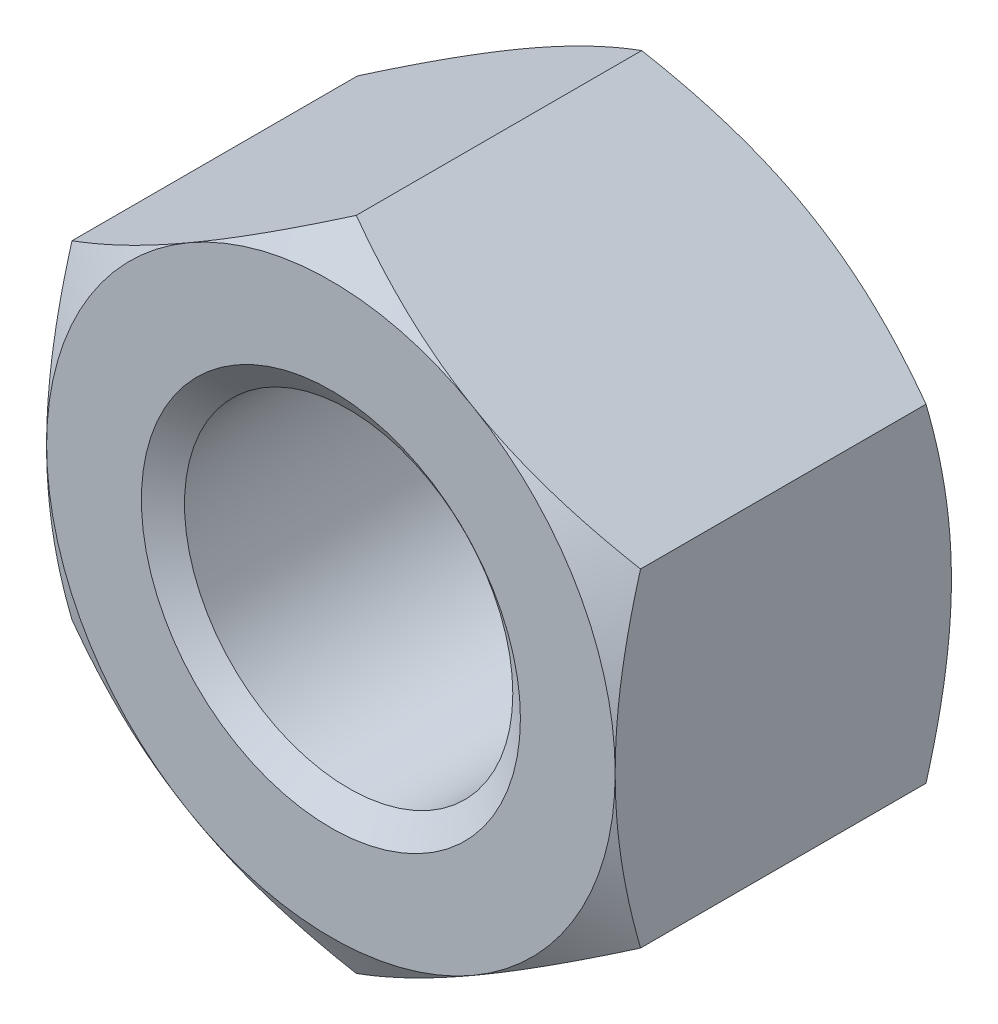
ISO-10303-21;
HEADER;
FILE_DESCRIPTION(('STEP AP214'),'2;1');
FILE_NAME('part.step','',(''),(''),'','','');
FILE_SCHEMA(('AUTOMOTIVE_DESIGN { 1 0 10303 214 1 1 1 1 }'));
ENDSEC;
DATA;
#1=APPLICATION_CONTEXT('core data for automotive mechanical design processes');
#2=APPLICATION_PROTOCOL_DEFINITION('international standard','automotive_design',2000,#1);
#3=PRODUCT_CONTEXT('',#1,'mechanical');
#4=PRODUCT('Part','Part','',(#3));
#5=PRODUCT_RELATED_PRODUCT_CATEGORY('part','',(#4));
#6=PRODUCT_DEFINITION_FORMATION('','',#4);
#7=PRODUCT_DEFINITION_CONTEXT('part definition',#1,'design');
#8=PRODUCT_DEFINITION('design','',#6,#7);
#9=PRODUCT_DEFINITION_SHAPE('','',#8);
#10=(LENGTH_UNIT() NAMED_UNIT(*) SI_UNIT(.MILLI.,.METRE.));
#11=(NAMED_UNIT(*) PLANE_ANGLE_UNIT() SI_UNIT($,.RADIAN.));
#12=(NAMED_UNIT(*) SI_UNIT($,.STERADIAN.) SOLID_ANGLE_UNIT());
#13=UNCERTAINTY_MEASURE_WITH_UNIT(LENGTH_MEASURE(1.E-05),#10,'distance_accuracy_value','');
#14=(GEOMETRIC_REPRESENTATION_CONTEXT(3) GLOBAL_UNCERTAINTY_ASSIGNED_CONTEXT((#13)) GLOBAL_UNIT_ASSIGNED_CONTEXT((#10,
#11,#12)) REPRESENTATION_CONTEXT('',''));
#15=CARTESIAN_POINT('',(0.,0.,0.));
#16=DIRECTION('',(0.,0.,1.));
#17=DIRECTION('',(1.,0.,0.));
#18=AXIS2_PLACEMENT_3D('',#15,#16,#17);
#19=CARTESIAN_POINT('',(0.,0.,-22.5298));
#20=DIRECTION('',(0.,0.,1.));
#21=DIRECTION('',(1.,0.,0.));
#22=AXIS2_PLACEMENT_3D('',#19,#20,#21);
#23=CYLINDRICAL_SURFACE('',#22,11.);
#24=CARTESIAN_POINT('',(0.,0.,-1.1903528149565));
#25=DIRECTION('',(0.,0.,1.));
#26=DIRECTION('',(1.,0.,0.));
#27=AXIS2_PLACEMENT_3D('',#24,#25,#26);
#28=CIRCLE('',#27,11.);
#29=CARTESIAN_POINT('',(11.,0.,-1.1903528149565));
#30=VERTEX_POINT('',#29);
#31=EDGE_CURVE('E150',#30,#30,#28,.F.);
#32=ORIENTED_EDGE('',*,*,#31,.F.);
#33=EDGE_LOOP('',(#32));
#34=FACE_BOUND('',#33,.T.);
#35=CARTESIAN_POINT('',(0.,0.,-21.3140471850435));
#36=DIRECTION('',(0.,0.,-1.));
#37=DIRECTION('',(-1.,0.,0.));
#38=AXIS2_PLACEMENT_3D('',#35,#36,#37);
#39=CIRCLE('',#38,11.);
#40=CARTESIAN_POINT('',(-11.,0.,-21.3140471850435));
#41=VERTEX_POINT('',#40);
#42=EDGE_CURVE('E40',#41,#41,#39,.F.);
#43=ORIENTED_EDGE('',*,*,#42,.F.);
#44=EDGE_LOOP('',(#43));
#45=FACE_BOUND('',#44,.T.);
#46=ADVANCED_FACE('F35',(#34,#45),#23,.F.);
#47=CARTESIAN_POINT('',(-38.1,0.,-22.5298));
#48=DIRECTION('',(0.,0.,1.));
#49=DIRECTION('',(1.,0.,0.));
#50=AXIS2_PLACEMENT_3D('',#47,#48,#49);
#51=PLANE('',#50);
#52=CARTESIAN_POINT('',(0.,0.,-22.5298));
#53=DIRECTION('',(0.,0.,1.));
#54=DIRECTION('',(1.,0.,0.));
#55=AXIS2_PLACEMENT_3D('',#52,#53,#54);
#56=CIRCLE('',#55,19.05);
#57=CARTESIAN_POINT('',(19.05,0.,-22.5298));
#58=VERTEX_POINT('',#57);
#59=CARTESIAN_POINT('',(9.52500000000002,16.4977839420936,-22.5298));
#60=VERTEX_POINT('',#59);
#61=EDGE_CURVE('E157',#58,#60,#56,.T.);
#62=ORIENTED_EDGE('',*,*,#61,.F.);
#63=CARTESIAN_POINT('',(0.,0.,-22.5298));
#64=DIRECTION('',(0.,0.,1.));
#65=DIRECTION('',(1.,0.,0.));
#66=AXIS2_PLACEMENT_3D('',#63,#64,#65);
#67=CIRCLE('',#66,19.05);
#68=CARTESIAN_POINT('',(9.52500000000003,-16.4977839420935,-22.5298));
#69=VERTEX_POINT('',#68);
#70=EDGE_CURVE('E262',#58,#69,#67,.F.);
#71=ORIENTED_EDGE('',*,*,#70,.T.);
#72=CARTESIAN_POINT('',(-9.52500000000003,-16.4977839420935,-22.5298));
#73=VERTEX_POINT('',#72);
#74=EDGE_CURVE('E264',#69,#73,#67,.F.);
#75=ORIENTED_EDGE('',*,*,#74,.T.);
#76=CARTESIAN_POINT('',(-19.05,0.,-22.5298));
#77=VERTEX_POINT('',#76);
#78=EDGE_CURVE('E389',#73,#77,#67,.F.);
#79=ORIENTED_EDGE('',*,*,#78,.T.);
#80=CARTESIAN_POINT('',(-9.52500000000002,16.4977839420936,-22.5298));
#81=VERTEX_POINT('',#80);
#82=EDGE_CURVE('E392',#77,#81,#67,.F.);
#83=ORIENTED_EDGE('',*,*,#82,.T.);
#84=EDGE_CURVE('E247',#81,#60,#67,.F.);
#85=ORIENTED_EDGE('',*,*,#84,.T.);
#86=EDGE_LOOP('',(#62,#71,#75,#79,#83,#85));
#87=FACE_BOUND('',#86,.T.);
#88=CARTESIAN_POINT('',(0.,0.,-22.5298));
#89=DIRECTION('',(0.,0.,1.));
#90=DIRECTION('',(1.,0.,0.));
#91=AXIS2_PLACEMENT_3D('',#88,#89,#90);
#92=CIRCLE('',#91,12.7);
#93=CARTESIAN_POINT('',(12.7,0.,-22.5298));
#94=VERTEX_POINT('',#93);
#95=EDGE_CURVE('E269',#94,#94,#92,.F.);
#96=ORIENTED_EDGE('',*,*,#95,.F.);
#97=EDGE_LOOP('',(#96));
#98=FACE_BOUND('',#97,.T.);
#99=ADVANCED_FACE('F285',(#87,#98),#51,.F.);
#100=CARTESIAN_POINT('',(-38.1,0.,0.));
#101=DIRECTION('',(0.,0.,1.));
#102=DIRECTION('',(1.,0.,0.));
#103=AXIS2_PLACEMENT_3D('',#100,#101,#102);
#104=PLANE('',#103);
#105=CARTESIAN_POINT('',(0.,0.,0.));
#106=DIRECTION('',(0.,0.,1.));
#107=DIRECTION('',(1.,0.,0.));
#108=AXIS2_PLACEMENT_3D('',#105,#106,#107);
#109=CIRCLE('',#108,19.05);
#110=CARTESIAN_POINT('',(9.52500000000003,-16.4977839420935,0.));
#111=VERTEX_POINT('',#110);
#112=CARTESIAN_POINT('',(19.05,0.,0.));
#113=VERTEX_POINT('',#112);
#114=EDGE_CURVE('E47',#111,#113,#109,.T.);
#115=ORIENTED_EDGE('',*,*,#114,.T.);
#116=CARTESIAN_POINT('',(0.,0.,0.));
#117=DIRECTION('',(0.,0.,1.));
#118=DIRECTION('',(1.,0.,0.));
#119=AXIS2_PLACEMENT_3D('',#116,#117,#118);
#120=CIRCLE('',#119,19.05);
#121=CARTESIAN_POINT('',(9.52500000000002,16.4977839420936,0.));
#122=VERTEX_POINT('',#121);
#123=EDGE_CURVE('E54',#113,#122,#120,.T.);
#124=ORIENTED_EDGE('',*,*,#123,.T.);
#125=CARTESIAN_POINT('',(-9.52500000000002,16.4977839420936,0.));
#126=VERTEX_POINT('',#125);
#127=EDGE_CURVE('E11',#122,#126,#109,.T.);
#128=ORIENTED_EDGE('',*,*,#127,.T.);
#129=CARTESIAN_POINT('',(-19.05,0.,0.));
#130=VERTEX_POINT('',#129);
#131=EDGE_CURVE('E45',#126,#130,#109,.T.);
#132=ORIENTED_EDGE('',*,*,#131,.T.);
#133=CARTESIAN_POINT('',(-9.52500000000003,-16.4977839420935,0.));
#134=VERTEX_POINT('',#133);
#135=EDGE_CURVE('E338',#130,#134,#109,.T.);
#136=ORIENTED_EDGE('',*,*,#135,.T.);
#137=EDGE_CURVE('E266',#134,#111,#109,.T.);
#138=ORIENTED_EDGE('',*,*,#137,.T.);
#139=EDGE_LOOP('',(#115,#124,#128,#132,#136,#138));
#140=FACE_BOUND('',#139,.T.);
#141=CARTESIAN_POINT('',(0.,0.,0.));
#142=DIRECTION('',(0.,0.,1.));
#143=DIRECTION('',(1.,0.,0.));
#144=AXIS2_PLACEMENT_3D('',#141,#142,#143);
#145=CIRCLE('',#144,12.7);
#146=CARTESIAN_POINT('',(12.7,0.,0.));
#147=VERTEX_POINT('',#146);
#148=EDGE_CURVE('E268',#147,#147,#145,.T.);
#149=ORIENTED_EDGE('',*,*,#148,.F.);
#150=EDGE_LOOP('',(#149));
#151=FACE_BOUND('',#150,.T.);
#152=ADVANCED_FACE('F145',(#140,#151),#104,.T.);
#153=CARTESIAN_POINT('',(0.,21.9970452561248,-22.5298));
#154=DIRECTION('',(-0.500000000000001,0.866025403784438,0.));
#155=DIRECTION('',(-0.866025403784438,-0.500000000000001,0.));
#156=AXIS2_PLACEMENT_3D('',#153,#154,#155);
#157=PLANE('',#156);
#158=DIRECTION('',(0.,0.,1.));
#159=VECTOR('',#158,1.);
#160=CARTESIAN_POINT('',(-19.05,10.9985226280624,-22.5298));
#161=LINE('',#160,#159);
#162=CARTESIAN_POINT('',(-19.05,10.9985226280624,-20.8283226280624));
#163=VERTEX_POINT('',#162);
#164=CARTESIAN_POINT('',(-19.05,10.9985226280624,-1.70147737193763));
#165=VERTEX_POINT('',#164);
#166=EDGE_CURVE('E259',#163,#165,#161,.T.);
#167=ORIENTED_EDGE('',*,*,#166,.T.);
#168=CARTESIAN_POINT('',(-19.0502,10.9984071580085,-1.70154403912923));
#169=CARTESIAN_POINT('',(-18.6314889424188,11.2401500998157,-1.56198341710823));
#170=CARTESIAN_POINT('',(-18.2111446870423,11.4828359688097,-1.42875584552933));
#171=CARTESIAN_POINT('',(-17.3670855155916,11.9701537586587,-1.17672716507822));
#172=CARTESIAN_POINT('',(-16.9433695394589,12.2147862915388,-1.05793080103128));
#173=CARTESIAN_POINT('',(-16.0917480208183,12.7064702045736,-0.836361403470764));
#174=CARTESIAN_POINT('',(-15.6638350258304,12.9535258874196,-0.733626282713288));
#175=CARTESIAN_POINT('',(-14.8050356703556,13.4493539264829,-0.546385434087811));
#176=CARTESIAN_POINT('',(-14.374149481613,13.6981261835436,-0.461878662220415));
#177=CARTESIAN_POINT('',(-13.5204444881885,14.1910129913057,-0.314688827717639));
#178=CARTESIAN_POINT('',(-13.0976890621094,14.4350909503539,-0.251518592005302));
#179=CARTESIAN_POINT('',(-12.250241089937,14.9243652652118,-0.14559634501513));
#180=CARTESIAN_POINT('',(-11.8255485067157,15.1695616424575,-0.102844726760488));
#181=CARTESIAN_POINT('',(-10.9754499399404,15.6603662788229,-0.0388391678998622));
#182=CARTESIAN_POINT('',(-10.5500454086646,15.9059736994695,-0.0175596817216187));
#183=CARTESIAN_POINT('',(-9.6988436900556,16.397415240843,0.00304398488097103));
#184=CARTESIAN_POINT('',(-9.27304651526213,16.6432493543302,0.00236884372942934));
#185=CARTESIAN_POINT('',(-8.47700964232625,17.1028414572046,-0.0194033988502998));
#186=CARTESIAN_POINT('',(-8.10671322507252,17.316632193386,-0.0378455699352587));
#187=CARTESIAN_POINT('',(-7.36700369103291,17.7437036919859,-0.0909844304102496));
#188=CARTESIAN_POINT('',(-6.99759056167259,17.9569844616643,-0.125680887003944));
#189=CARTESIAN_POINT('',(-6.25978756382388,18.3829552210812,-0.210726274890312));
#190=CARTESIAN_POINT('',(-5.89139892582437,18.5956445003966,-0.261089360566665));
#191=CARTESIAN_POINT('',(-5.15637533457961,19.0200105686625,-0.376579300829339));
#192=CARTESIAN_POINT('',(-4.78974037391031,19.2316873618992,-0.441706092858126));
#193=CARTESIAN_POINT('',(-3.6767727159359,19.8742595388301,-0.660888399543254));
#194=CARTESIAN_POINT('',(-2.93366305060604,20.3032941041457,-0.836799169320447));
#195=CARTESIAN_POINT('',(-1.45852420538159,21.1549659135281,-1.23604434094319));
#196=CARTESIAN_POINT('',(-0.726476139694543,21.5776140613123,-1.45928498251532));
#197=CARTESIAN_POINT('',(0.000199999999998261,21.9971607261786,-1.70154403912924));
#198=B_SPLINE_CURVE_WITH_KNOTS('',3,(#168,#169,#170,#171,#172,#173,#174,#175,#176,#177,#178,
#179,#180,#181,#182,#183,#184,#185,#186,#187,#188,#189,#190,#191,#192,#193,#194,#195,#196,#197),
.UNSPECIFIED.,.F.,.F.,(4,2,2,2,2,2,2,2,2,2,2,2,2,2,4),(0.,1.50971559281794,3.01992622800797,
4.53364959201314,6.04728623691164,7.52356313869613,8.99986845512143,10.4744153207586,
11.9489166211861,13.2325441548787,14.5161533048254,15.8009255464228,17.085692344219,
19.7118183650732,22.3327898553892),.UNSPECIFIED.);
#199=EDGE_CURVE('E62',#165,#126,#198,.T.);
#200=ORIENTED_EDGE('',*,*,#199,.T.);
#201=CARTESIAN_POINT('',(0.,21.9970452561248,-1.70147737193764));
#202=VERTEX_POINT('',#201);
#203=EDGE_CURVE('E141',#126,#202,#198,.T.);
#204=ORIENTED_EDGE('',*,*,#203,.T.);
#205=DIRECTION('',(0.,0.,1.));
#206=VECTOR('',#205,1.);
#207=CARTESIAN_POINT('',(0.,21.9970452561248,-22.5298));
#208=LINE('',#207,#206);
#209=CARTESIAN_POINT('',(0.,21.9970452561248,-20.8283226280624));
#210=VERTEX_POINT('',#209);
#211=EDGE_CURVE('E156',#210,#202,#208,.T.);
#212=ORIENTED_EDGE('',*,*,#211,.F.);
#213=CARTESIAN_POINT('',(-19.0502,10.9984071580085,-20.8282559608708));
#214=CARTESIAN_POINT('',(-18.6314889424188,11.2401500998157,-20.9678165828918));
#215=CARTESIAN_POINT('',(-18.2111446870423,11.4828359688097,-21.1010441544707));
#216=CARTESIAN_POINT('',(-17.3670855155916,11.9701537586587,-21.3530728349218));
#217=CARTESIAN_POINT('',(-16.9433695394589,12.2147862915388,-21.4718691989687));
#218=CARTESIAN_POINT('',(-16.0917480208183,12.7064702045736,-21.6934385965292));
#219=CARTESIAN_POINT('',(-15.6638350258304,12.9535258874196,-21.7961737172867));
#220=CARTESIAN_POINT('',(-14.8050356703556,13.4493539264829,-21.9834145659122));
#221=CARTESIAN_POINT('',(-14.374149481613,13.6981261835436,-22.0679213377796));
#222=CARTESIAN_POINT('',(-13.5204444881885,14.1910129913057,-22.2151111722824));
#223=CARTESIAN_POINT('',(-13.0976890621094,14.4350909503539,-22.2782814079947));
#224=CARTESIAN_POINT('',(-12.250241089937,14.9243652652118,-22.3842036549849));
#225=CARTESIAN_POINT('',(-11.8255485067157,15.1695616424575,-22.4269552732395));
#226=CARTESIAN_POINT('',(-10.9754499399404,15.6603662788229,-22.4909608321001));
#227=CARTESIAN_POINT('',(-10.5500454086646,15.9059736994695,-22.5122403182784));
#228=CARTESIAN_POINT('',(-9.6988436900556,16.397415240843,-22.532843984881));
#229=CARTESIAN_POINT('',(-9.27304651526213,16.6432493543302,-22.5321688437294));
#230=CARTESIAN_POINT('',(-8.47700964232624,17.1028414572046,-22.5103966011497));
#231=CARTESIAN_POINT('',(-8.10671322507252,17.316632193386,-22.4919544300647));
#232=CARTESIAN_POINT('',(-7.3670036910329,17.7437036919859,-22.4388155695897));
#233=CARTESIAN_POINT('',(-6.99759056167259,17.9569844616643,-22.4041191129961));
#234=CARTESIAN_POINT('',(-6.25978756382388,18.3829552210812,-22.3190737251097));
#235=CARTESIAN_POINT('',(-5.89139892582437,18.5956445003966,-22.2687106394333));
#236=CARTESIAN_POINT('',(-5.15637533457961,19.0200105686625,-22.1532206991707));
#237=CARTESIAN_POINT('',(-4.7897403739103,19.2316873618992,-22.0880939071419));
#238=CARTESIAN_POINT('',(-3.67677271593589,19.8742595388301,-21.8689116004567));
#239=CARTESIAN_POINT('',(-2.93366305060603,20.3032941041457,-21.6930008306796));
#240=CARTESIAN_POINT('',(-1.45852420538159,21.1549659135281,-21.2937556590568));
#241=CARTESIAN_POINT('',(-0.726476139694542,21.5776140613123,-21.0705150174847));
#242=CARTESIAN_POINT('',(0.000199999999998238,21.9971607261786,-20.8282559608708));
#243=B_SPLINE_CURVE_WITH_KNOTS('',3,(#213,#214,#215,#216,#217,#218,#219,#220,#221,#222,#223,
#224,#225,#226,#227,#228,#229,#230,#231,#232,#233,#234,#235,#236,#237,#238,#239,#240,#241,#242),
.UNSPECIFIED.,.F.,.F.,(4,2,2,2,2,2,2,2,2,2,2,2,2,2,4),(0.,1.50971559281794,3.01992622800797,
4.53364959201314,6.04728623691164,7.52356313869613,8.99986845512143,10.4744153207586,
11.9489166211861,13.2325441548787,14.5161533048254,15.8009255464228,17.085692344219,
19.7118183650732,22.3327898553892),.UNSPECIFIED.);
#244=EDGE_CURVE('E239',#81,#210,#243,.T.);
#245=ORIENTED_EDGE('',*,*,#244,.F.);
#246=EDGE_CURVE('E227',#163,#81,#243,.T.);
#247=ORIENTED_EDGE('',*,*,#246,.F.);
#248=EDGE_LOOP('',(#167,#200,#204,#212,#245,#247));
#249=FACE_BOUND('',#248,.T.);
#250=ADVANCED_FACE('F37',(#249),#157,.T.);
#251=CARTESIAN_POINT('',(19.05,10.9985226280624,-22.5298));
#252=DIRECTION('',(0.500000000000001,0.866025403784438,0.));
#253=DIRECTION('',(-0.866025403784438,0.500000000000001,0.));
#254=AXIS2_PLACEMENT_3D('',#251,#252,#253);
#255=PLANE('',#254);
#256=ORIENTED_EDGE('',*,*,#211,.T.);
#257=CARTESIAN_POINT('',(-0.000200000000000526,21.9971607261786,-1.70154403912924));
#258=CARTESIAN_POINT('',(0.418511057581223,21.7554177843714,-1.56198341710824));
#259=CARTESIAN_POINT('',(0.83885531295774,21.5127319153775,-1.42875584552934));
#260=CARTESIAN_POINT('',(1.68291448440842,21.0254141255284,-1.17672716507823));
#261=CARTESIAN_POINT('',(2.10663046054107,20.7807815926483,-1.05793080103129));
#262=CARTESIAN_POINT('',(2.95825197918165,20.2890976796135,-0.836361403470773));
#263=CARTESIAN_POINT('',(3.38616497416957,20.0420419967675,-0.733626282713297));
#264=CARTESIAN_POINT('',(4.24496432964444,19.5462139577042,-0.54638543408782));
#265=CARTESIAN_POINT('',(4.67585051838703,19.2974417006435,-0.461878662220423));
#266=CARTESIAN_POINT('',(5.52955551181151,18.8045548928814,-0.314688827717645));
#267=CARTESIAN_POINT('',(5.95231093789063,18.5604769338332,-0.251518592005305));
#268=CARTESIAN_POINT('',(6.79975891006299,18.0712026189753,-0.145596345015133));
#269=CARTESIAN_POINT('',(7.22445149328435,17.8260062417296,-0.102844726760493));
#270=CARTESIAN_POINT('',(8.07455006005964,17.3352016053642,-0.0388391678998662));
#271=CARTESIAN_POINT('',(8.49995459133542,17.0895941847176,-0.0175596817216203));
#272=CARTESIAN_POINT('',(9.35115630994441,16.5981526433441,0.00304398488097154));
#273=CARTESIAN_POINT('',(9.77695348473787,16.3523185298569,0.00236884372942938));
#274=CARTESIAN_POINT('',(10.5729903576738,15.8927264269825,-0.019403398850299));
#275=CARTESIAN_POINT('',(10.9432867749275,15.6789356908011,-0.0378455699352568));
#276=CARTESIAN_POINT('',(11.6829963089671,15.2518641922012,-0.090984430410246));
#277=CARTESIAN_POINT('',(12.0524094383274,15.0385834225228,-0.12568088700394));
#278=CARTESIAN_POINT('',(12.7902124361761,14.612612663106,-0.210726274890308));
#279=CARTESIAN_POINT('',(13.1586010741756,14.3999233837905,-0.261089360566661));
#280=CARTESIAN_POINT('',(13.8936246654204,13.9755573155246,-0.376579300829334));
#281=CARTESIAN_POINT('',(14.2602596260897,13.7638805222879,-0.441706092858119));
#282=CARTESIAN_POINT('',(15.3732272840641,13.121308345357,-0.660888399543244));
#283=CARTESIAN_POINT('',(16.116336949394,12.6922737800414,-0.836799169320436));
#284=CARTESIAN_POINT('',(17.5914757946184,11.840601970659,-1.23604434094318));
#285=CARTESIAN_POINT('',(18.3235238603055,11.4179538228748,-1.45928498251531));
#286=CARTESIAN_POINT('',(19.0502,10.9984071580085,-1.70154403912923));
#287=B_SPLINE_CURVE_WITH_KNOTS('',3,(#257,#258,#259,#260,#261,#262,#263,#264,#265,#266,#267,
#268,#269,#270,#271,#272,#273,#274,#275,#276,#277,#278,#279,#280,#281,#282,#283,#284,#285,#286),
.UNSPECIFIED.,.F.,.F.,(4,2,2,2,2,2,2,2,2,2,2,2,2,2,4),(0.,1.50971559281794,3.01992622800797,
4.53364959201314,6.04728623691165,7.52356313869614,8.99986845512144,10.4744153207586,
11.9489166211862,13.2325441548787,14.5161533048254,15.8009255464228,17.085692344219,
19.7118183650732,22.3327898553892),.UNSPECIFIED.);
#288=EDGE_CURVE('E136',#202,#122,#287,.T.);
#289=ORIENTED_EDGE('',*,*,#288,.T.);
#290=CARTESIAN_POINT('',(19.05,10.9985226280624,-1.70147737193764));
#291=VERTEX_POINT('',#290);
#292=EDGE_CURVE('E127',#122,#291,#287,.T.);
#293=ORIENTED_EDGE('',*,*,#292,.T.);
#294=DIRECTION('',(0.,0.,1.));
#295=VECTOR('',#294,1.);
#296=CARTESIAN_POINT('',(19.05,10.9985226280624,-22.5298));
#297=LINE('',#296,#295);
#298=CARTESIAN_POINT('',(19.05,10.9985226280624,-20.8283226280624));
#299=VERTEX_POINT('',#298);
#300=EDGE_CURVE('E248',#299,#291,#297,.T.);
#301=ORIENTED_EDGE('',*,*,#300,.F.);
#302=CARTESIAN_POINT('',(-0.000200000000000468,21.9971607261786,-20.8282559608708));
#303=CARTESIAN_POINT('',(0.418511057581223,21.7554177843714,-20.9678165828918));
#304=CARTESIAN_POINT('',(0.838855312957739,21.5127319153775,-21.1010441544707));
#305=CARTESIAN_POINT('',(1.68291448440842,21.0254141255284,-21.3530728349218));
#306=CARTESIAN_POINT('',(2.10663046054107,20.7807815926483,-21.4718691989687));
#307=CARTESIAN_POINT('',(2.95825197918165,20.2890976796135,-21.6934385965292));
#308=CARTESIAN_POINT('',(3.38616497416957,20.0420419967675,-21.7961737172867));
#309=CARTESIAN_POINT('',(4.24496432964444,19.5462139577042,-21.9834145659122));
#310=CARTESIAN_POINT('',(4.67585051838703,19.2974417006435,-22.0679213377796));
#311=CARTESIAN_POINT('',(5.52955551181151,18.8045548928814,-22.2151111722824));
#312=CARTESIAN_POINT('',(5.95231093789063,18.5604769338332,-22.2782814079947));
#313=CARTESIAN_POINT('',(6.79975891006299,18.0712026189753,-22.3842036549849));
#314=CARTESIAN_POINT('',(7.22445149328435,17.8260062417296,-22.4269552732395));
#315=CARTESIAN_POINT('',(8.07455006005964,17.3352016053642,-22.4909608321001));
#316=CARTESIAN_POINT('',(8.49995459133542,17.0895941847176,-22.5122403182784));
#317=CARTESIAN_POINT('',(9.35115630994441,16.5981526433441,-22.532843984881));
#318=CARTESIAN_POINT('',(9.77695348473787,16.3523185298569,-22.5321688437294));
#319=CARTESIAN_POINT('',(10.5729903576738,15.8927264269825,-22.5103966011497));
#320=CARTESIAN_POINT('',(10.9432867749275,15.6789356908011,-22.4919544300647));
#321=CARTESIAN_POINT('',(11.6829963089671,15.2518641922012,-22.4388155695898));
#322=CARTESIAN_POINT('',(12.0524094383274,15.0385834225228,-22.4041191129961));
#323=CARTESIAN_POINT('',(12.7902124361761,14.612612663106,-22.3190737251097));
#324=CARTESIAN_POINT('',(13.1586010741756,14.3999233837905,-22.2687106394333));
#325=CARTESIAN_POINT('',(13.8936246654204,13.9755573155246,-22.1532206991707));
#326=CARTESIAN_POINT('',(14.2602596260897,13.7638805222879,-22.0880939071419));
#327=CARTESIAN_POINT('',(15.3732272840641,13.121308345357,-21.8689116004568));
#328=CARTESIAN_POINT('',(16.116336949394,12.6922737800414,-21.6930008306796));
#329=CARTESIAN_POINT('',(17.5914757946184,11.840601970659,-21.2937556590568));
#330=CARTESIAN_POINT('',(18.3235238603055,11.4179538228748,-21.0705150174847));
#331=CARTESIAN_POINT('',(19.0502,10.9984071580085,-20.8282559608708));
#332=B_SPLINE_CURVE_WITH_KNOTS('',3,(#302,#303,#304,#305,#306,#307,#308,#309,#310,#311,#312,
#313,#314,#315,#316,#317,#318,#319,#320,#321,#322,#323,#324,#325,#326,#327,#328,#329,#330,#331),
.UNSPECIFIED.,.F.,.F.,(4,2,2,2,2,2,2,2,2,2,2,2,2,2,4),(0.,1.50971559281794,3.01992622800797,
4.53364959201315,6.04728623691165,7.52356313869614,8.99986845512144,10.4744153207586,
11.9489166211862,13.2325441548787,14.5161533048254,15.8009255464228,17.085692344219,
19.7118183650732,22.3327898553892),.UNSPECIFIED.);
#333=EDGE_CURVE('E240',#60,#299,#332,.T.);
#334=ORIENTED_EDGE('',*,*,#333,.F.);
#335=EDGE_CURVE('E245',#210,#60,#332,.T.);
#336=ORIENTED_EDGE('',*,*,#335,.F.);
#337=EDGE_LOOP('',(#256,#289,#293,#301,#334,#336));
#338=FACE_BOUND('',#337,.T.);
#339=ADVANCED_FACE('F153',(#338),#255,.T.);
#340=CARTESIAN_POINT('',(19.05,10.9985226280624,-22.5298));
#341=DIRECTION('',(-1.,0.,0.));
#342=DIRECTION('',(0.,0.,1.));
#343=AXIS2_PLACEMENT_3D('',#340,#341,#342);
#344=PLANE('',#343);
#345=CARTESIAN_POINT('',(19.05,-29.169702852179,-9.1159337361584));
#346=CARTESIAN_POINT('',(19.05,-28.7515170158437,-8.91378890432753));
#347=CARTESIAN_POINT('',(19.05,-28.3328257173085,-8.7126902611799));
#348=CARTESIAN_POINT('',(19.05,-27.494325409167,-8.31282549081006));
#349=CARTESIAN_POINT('',(19.05,-27.0745163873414,-8.11405938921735));
#350=CARTESIAN_POINT('',(19.05,-25.813129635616,-7.52156252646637));
#351=CARTESIAN_POINT('',(19.05,-24.9697281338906,-7.1316990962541));
#352=CARTESIAN_POINT('',(19.05,-23.2722707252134,-6.36257122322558));
#353=CARTESIAN_POINT('',(19.05,-22.4181814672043,-5.98338020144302));
#354=CARTESIAN_POINT('',(19.05,-20.7029839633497,-5.24127883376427));
#355=CARTESIAN_POINT('',(19.05,-19.8418760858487,-4.87836763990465));
#356=CARTESIAN_POINT('',(19.05,-18.1005821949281,-4.1688569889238));
#357=CARTESIAN_POINT('',(19.05,-17.2202917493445,-3.82251248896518));
#358=CARTESIAN_POINT('',(19.05,-15.4493217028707,-3.15694792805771));
#359=CARTESIAN_POINT('',(19.05,-14.5586409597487,-2.83773088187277));
#360=CARTESIAN_POINT('',(19.05,-12.7673320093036,-2.2350028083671));
#361=CARTESIAN_POINT('',(19.05,-11.8667295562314,-1.95141586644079));
#362=CARTESIAN_POINT('',(19.05,-10.0526343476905,-1.42914392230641));
#363=CARTESIAN_POINT('',(19.05,-9.13914576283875,-1.19044473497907));
#364=CARTESIAN_POINT('',(19.05,-7.7590746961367,-0.874799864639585));
#365=CARTESIAN_POINT('',(19.05,-7.29731333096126,-0.776636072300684));
#366=CARTESIAN_POINT('',(19.05,-6.37071732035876,-0.595993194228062));
#367=CARTESIAN_POINT('',(19.05,-5.90588274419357,-0.513513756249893));
#368=CARTESIAN_POINT('',(19.05,-4.97345228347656,-0.36570182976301));
#369=CARTESIAN_POINT('',(19.05,-4.50585623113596,-0.300370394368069));
#370=CARTESIAN_POINT('',(19.05,-3.56843861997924,-0.188166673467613));
#371=CARTESIAN_POINT('',(19.05,-3.09861705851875,-0.141294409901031));
#372=CARTESIAN_POINT('',(19.05,-2.16041609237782,-0.067270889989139));
#373=CARTESIAN_POINT('',(19.05,-1.69204648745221,-0.0399962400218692));
#374=CARTESIAN_POINT('',(19.05,-0.754574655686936,-0.00531133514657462));
#375=CARTESIAN_POINT('',(19.05,-0.285472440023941,0.00209921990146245));
#376=CARTESIAN_POINT('',(19.05,0.652492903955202,-0.0031198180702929));
#377=CARTESIAN_POINT('',(19.05,1.12135606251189,-0.015743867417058));
#378=CARTESIAN_POINT('',(19.05,2.05813737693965,-0.0607182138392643));
#379=CARTESIAN_POINT('',(19.05,2.52605549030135,-0.0930693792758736));
#380=CARTESIAN_POINT('',(19.05,3.65980250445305,-0.194680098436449));
#381=CARTESIAN_POINT('',(19.05,4.32476458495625,-0.273803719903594));
#382=CARTESIAN_POINT('',(19.05,5.64947952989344,-0.467485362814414));
#383=CARTESIAN_POINT('',(19.05,6.30923160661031,-0.582048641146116));
#384=CARTESIAN_POINT('',(19.05,8.28182382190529,-0.973151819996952));
#385=CARTESIAN_POINT('',(19.05,9.58542312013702,-1.29684470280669));
#386=CARTESIAN_POINT('',(19.05,11.5353898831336,-1.85499845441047));
#387=CARTESIAN_POINT('',(19.05,12.191945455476,-2.05588340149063));
#388=CARTESIAN_POINT('',(19.05,13.498713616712,-2.47768236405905));
#389=CARTESIAN_POINT('',(19.05,14.1489256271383,-2.69859818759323));
#390=CARTESIAN_POINT('',(19.05,15.4397656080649,-3.15575174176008));
#391=CARTESIAN_POINT('',(19.05,16.0804269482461,-3.39189604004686));
#392=CARTESIAN_POINT('',(19.05,17.0373840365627,-3.75633654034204));
#393=CARTESIAN_POINT('',(19.05,17.3556458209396,-3.87949985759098));
#394=CARTESIAN_POINT('',(19.05,17.9909330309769,-4.12895791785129));
#395=CARTESIAN_POINT('',(19.05,18.3079584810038,-4.25525259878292));
#396=CARTESIAN_POINT('',(19.05,18.6244086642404,-4.38297164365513));
#397=B_SPLINE_CURVE_WITH_KNOTS('',3,(#345,#346,#347,#348,#349,#350,#351,#352,#353,#354,#355,
#356,#357,#358,#359,#360,#361,#362,#363,#364,#365,#366,#367,#368,#369,#370,#371,#372,#373,#374,
#375,#376,#377,#378,#379,#380,#381,#382,#383,#384,#385,#386,#387,#388,#389,#390,#391,#392,#393,
#394,#395,#396),.UNSPECIFIED.,.F.,.F.,(4,2,2,2,2,2,2,2,2,2,2,2,2,2,2,2,2,2,2,2,2,2,2,2,2,4),(0.,
1.39343811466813,2.78689152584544,5.57425145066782,8.37756231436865,11.1807269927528,
14.0183059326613,16.856199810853,19.6879407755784,22.5187853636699,23.934802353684,
25.3507875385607,26.766859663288,28.1829334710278,29.5900111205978,30.9970675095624,
32.4037346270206,33.8104636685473,35.8182820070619,37.8263983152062,41.8503661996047,
43.9100054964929,45.9698308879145,48.0180400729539,49.0418117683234,50.0655631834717),.UNSPECIFIED.);
#398=CARTESIAN_POINT('',(19.05,-10.9985226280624,-1.70147737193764));
#399=VERTEX_POINT('',#398);
#400=EDGE_CURVE('E207',#399,#113,#397,.T.);
#401=ORIENTED_EDGE('',*,*,#400,.F.);
#402=DIRECTION('',(0.,0.,1.));
#403=VECTOR('',#402,1.);
#404=CARTESIAN_POINT('',(19.05,-10.9985226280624,-22.5298));
#405=LINE('',#404,#403);
#406=CARTESIAN_POINT('',(19.05,-10.9985226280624,-20.8283226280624));
#407=VERTEX_POINT('',#406);
#408=EDGE_CURVE('E250',#407,#399,#405,.T.);
#409=ORIENTED_EDGE('',*,*,#408,.F.);
#410=CARTESIAN_POINT('',(19.05,-29.169702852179,-13.4138662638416));
#411=CARTESIAN_POINT('',(19.05,-28.7515170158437,-13.6160110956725));
#412=CARTESIAN_POINT('',(19.05,-28.3328257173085,-13.8171097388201));
#413=CARTESIAN_POINT('',(19.05,-27.494325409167,-14.2169745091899));
#414=CARTESIAN_POINT('',(19.05,-27.0745163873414,-14.4157406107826));
#415=CARTESIAN_POINT('',(19.05,-25.813129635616,-15.0082374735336));
#416=CARTESIAN_POINT('',(19.05,-24.9697281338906,-15.3981009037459));
#417=CARTESIAN_POINT('',(19.05,-23.2722707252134,-16.1672287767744));
#418=CARTESIAN_POINT('',(19.05,-22.4181814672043,-16.546419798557));
#419=CARTESIAN_POINT('',(19.05,-20.7029839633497,-17.2885211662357));
#420=CARTESIAN_POINT('',(19.05,-19.8418760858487,-17.6514323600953));
#421=CARTESIAN_POINT('',(19.05,-18.1005821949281,-18.3609430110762));
#422=CARTESIAN_POINT('',(19.05,-17.2202917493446,-18.7072875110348));
#423=CARTESIAN_POINT('',(19.05,-15.4493217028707,-19.3728520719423));
#424=CARTESIAN_POINT('',(19.05,-14.5586409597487,-19.6920691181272));
#425=CARTESIAN_POINT('',(19.05,-12.7673320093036,-20.2947971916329));
#426=CARTESIAN_POINT('',(19.05,-11.8667295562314,-20.5783841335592));
#427=CARTESIAN_POINT('',(19.05,-10.0526343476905,-21.1006560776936));
#428=CARTESIAN_POINT('',(19.05,-9.13914576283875,-21.3393552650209));
#429=CARTESIAN_POINT('',(19.05,-7.7590746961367,-21.6550001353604));
#430=CARTESIAN_POINT('',(19.05,-7.29731333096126,-21.7531639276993));
#431=CARTESIAN_POINT('',(19.05,-6.37071732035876,-21.9338068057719));
#432=CARTESIAN_POINT('',(19.05,-5.90588274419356,-22.0162862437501));
#433=CARTESIAN_POINT('',(19.05,-4.97345228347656,-22.164098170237));
#434=CARTESIAN_POINT('',(19.05,-4.50585623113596,-22.2294296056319));
#435=CARTESIAN_POINT('',(19.05,-3.56843861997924,-22.3416333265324));
#436=CARTESIAN_POINT('',(19.05,-3.09861705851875,-22.388505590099));
#437=CARTESIAN_POINT('',(19.05,-2.16041609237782,-22.4625291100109));
#438=CARTESIAN_POINT('',(19.05,-1.69204648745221,-22.4898037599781));
#439=CARTESIAN_POINT('',(19.05,-0.754574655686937,-22.5244886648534));
#440=CARTESIAN_POINT('',(19.05,-0.285472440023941,-22.5318992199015));
#441=CARTESIAN_POINT('',(19.05,0.652492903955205,-22.5266801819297));
#442=CARTESIAN_POINT('',(19.05,1.12135606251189,-22.5140561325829));
#443=CARTESIAN_POINT('',(19.05,2.05813737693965,-22.4690817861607));
#444=CARTESIAN_POINT('',(19.05,2.52605549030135,-22.4367306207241));
#445=CARTESIAN_POINT('',(19.05,3.65980250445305,-22.3351199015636));
#446=CARTESIAN_POINT('',(19.05,4.32476458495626,-22.2559962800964));
#447=CARTESIAN_POINT('',(19.05,5.64947952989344,-22.0623146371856));
#448=CARTESIAN_POINT('',(19.05,6.30923160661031,-21.9477513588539));
#449=CARTESIAN_POINT('',(19.05,8.28182382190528,-21.556648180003));
#450=CARTESIAN_POINT('',(19.05,9.58542312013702,-21.2329552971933));
#451=CARTESIAN_POINT('',(19.05,11.5353898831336,-20.6748015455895));
#452=CARTESIAN_POINT('',(19.05,12.191945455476,-20.4739165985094));
#453=CARTESIAN_POINT('',(19.05,13.498713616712,-20.052117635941));
#454=CARTESIAN_POINT('',(19.05,14.1489256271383,-19.8312018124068));
#455=CARTESIAN_POINT('',(19.05,15.4397656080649,-19.3740482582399));
#456=CARTESIAN_POINT('',(19.05,16.080426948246,-19.1379039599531));
#457=CARTESIAN_POINT('',(19.05,17.0373840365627,-18.773463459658));
#458=CARTESIAN_POINT('',(19.05,17.3556458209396,-18.650300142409));
#459=CARTESIAN_POINT('',(19.05,17.9909330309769,-18.4008420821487));
#460=CARTESIAN_POINT('',(19.05,18.3079584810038,-18.2745474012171));
#461=CARTESIAN_POINT('',(19.05,18.6244086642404,-18.1468283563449));
#462=B_SPLINE_CURVE_WITH_KNOTS('',3,(#410,#411,#412,#413,#414,#415,#416,#417,#418,#419,#420,
#421,#422,#423,#424,#425,#426,#427,#428,#429,#430,#431,#432,#433,#434,#435,#436,#437,#438,#439,
#440,#441,#442,#443,#444,#445,#446,#447,#448,#449,#450,#451,#452,#453,#454,#455,#456,#457,#458,
#459,#460,#461),.UNSPECIFIED.,.F.,.F.,(4,2,2,2,2,2,2,2,2,2,2,2,2,2,2,2,2,2,2,2,2,2,2,2,2,4),(0.,
1.39343811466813,2.78689152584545,5.57425145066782,8.37756231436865,11.1807269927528,
14.0183059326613,16.856199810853,19.6879407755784,22.5187853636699,23.934802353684,
25.3507875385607,26.766859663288,28.1829334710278,29.5900111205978,30.9970675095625,
32.4037346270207,33.8104636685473,35.8182820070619,37.8263983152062,41.8503661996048,
43.9100054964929,45.9698308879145,48.0180400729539,49.0418117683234,50.0655631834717),.UNSPECIFIED.);
#463=EDGE_CURVE('E220',#407,#58,#462,.T.);
#464=ORIENTED_EDGE('',*,*,#463,.T.);
#465=EDGE_CURVE('E229',#58,#299,#462,.T.);
#466=ORIENTED_EDGE('',*,*,#465,.T.);
#467=ORIENTED_EDGE('',*,*,#300,.T.);
#468=EDGE_CURVE('E131',#113,#291,#397,.T.);
#469=ORIENTED_EDGE('',*,*,#468,.F.);
#470=EDGE_LOOP('',(#401,#409,#464,#466,#467,#469));
#471=FACE_BOUND('',#470,.T.);
#472=ADVANCED_FACE('F212',(#471),#344,.F.);
#473=CARTESIAN_POINT('',(0.,-21.9970452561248,-22.5298));
#474=DIRECTION('',(0.500000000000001,-0.866025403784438,0.));
#475=DIRECTION('',(0.866025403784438,0.500000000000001,0.));
#476=AXIS2_PLACEMENT_3D('',#473,#474,#475);
#477=PLANE('',#476);
#478=ORIENTED_EDGE('',*,*,#408,.T.);
#479=CARTESIAN_POINT('',(19.0502,-10.9984071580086,-1.70154403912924));
#480=CARTESIAN_POINT('',(18.6314889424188,-11.2401500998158,-1.56198341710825));
#481=CARTESIAN_POINT('',(18.2111446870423,-11.4828359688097,-1.42875584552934));
#482=CARTESIAN_POINT('',(17.3670855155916,-11.9701537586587,-1.17672716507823));
#483=CARTESIAN_POINT('',(16.9433695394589,-12.2147862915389,-1.05793080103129));
#484=CARTESIAN_POINT('',(16.0917480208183,-12.7064702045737,-0.836361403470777));
#485=CARTESIAN_POINT('',(15.6638350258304,-12.9535258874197,-0.733626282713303));
#486=CARTESIAN_POINT('',(14.8050356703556,-13.449353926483,-0.546385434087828));
#487=CARTESIAN_POINT('',(14.374149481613,-13.6981261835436,-0.461878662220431));
#488=CARTESIAN_POINT('',(13.5204444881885,-14.1910129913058,-0.314688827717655));
#489=CARTESIAN_POINT('',(13.0976890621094,-14.4350909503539,-0.251518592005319));
#490=CARTESIAN_POINT('',(12.250241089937,-14.9243652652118,-0.145596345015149));
#491=CARTESIAN_POINT('',(11.8255485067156,-15.1695616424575,-0.102844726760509));
#492=CARTESIAN_POINT('',(10.9754499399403,-15.660366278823,-0.0388391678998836));
#493=CARTESIAN_POINT('',(10.5500454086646,-15.9059736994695,-0.0175596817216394));
#494=CARTESIAN_POINT('',(9.69884369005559,-16.3974152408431,0.00304398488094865));
#495=CARTESIAN_POINT('',(9.27304651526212,-16.6432493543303,0.00236884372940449));
#496=CARTESIAN_POINT('',(8.47700964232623,-17.1028414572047,-0.019403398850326));
#497=CARTESIAN_POINT('',(8.10671322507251,-17.3166321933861,-0.0378455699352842));
#498=CARTESIAN_POINT('',(7.36700369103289,-17.743703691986,-0.0909844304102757));
#499=CARTESIAN_POINT('',(6.99759056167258,-17.9569844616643,-0.125680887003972));
#500=CARTESIAN_POINT('',(6.25978756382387,-18.3829552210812,-0.210726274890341));
#501=CARTESIAN_POINT('',(5.89139892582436,-18.5956445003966,-0.261089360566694));
#502=CARTESIAN_POINT('',(5.1563753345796,-19.0200105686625,-0.376579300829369));
#503=CARTESIAN_POINT('',(4.7897403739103,-19.2316873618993,-0.441706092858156));
#504=CARTESIAN_POINT('',(3.67677271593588,-19.8742595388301,-0.660888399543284));
#505=CARTESIAN_POINT('',(2.93366305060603,-20.3032941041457,-0.836799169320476));
#506=CARTESIAN_POINT('',(1.45852420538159,-21.1549659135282,-1.23604434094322));
#507=CARTESIAN_POINT('',(0.726476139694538,-21.5776140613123,-1.45928498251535));
#508=CARTESIAN_POINT('',(-0.000200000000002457,-21.9971607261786,-1.70154403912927));
#509=B_SPLINE_CURVE_WITH_KNOTS('',3,(#479,#480,#481,#482,#483,#484,#485,#486,#487,#488,#489,
#490,#491,#492,#493,#494,#495,#496,#497,#498,#499,#500,#501,#502,#503,#504,#505,#506,#507,#508),
.UNSPECIFIED.,.F.,.F.,(4,2,2,2,2,2,2,2,2,2,2,2,2,2,4),(0.,1.50971559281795,3.01992622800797,
4.53364959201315,6.04728623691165,7.52356313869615,8.99986845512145,10.4744153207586,
11.9489166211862,13.2325441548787,14.5161533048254,15.8009255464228,17.085692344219,
19.7118183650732,22.3327898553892),.UNSPECIFIED.);
#510=EDGE_CURVE('E211',#399,#111,#509,.T.);
#511=ORIENTED_EDGE('',*,*,#510,.T.);
#512=CARTESIAN_POINT('',(0.,-21.9970452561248,-1.70147737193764));
#513=VERTEX_POINT('',#512);
#514=EDGE_CURVE('E202',#111,#513,#509,.T.);
#515=ORIENTED_EDGE('',*,*,#514,.T.);
#516=DIRECTION('',(0.,0.,1.));
#517=VECTOR('',#516,1.);
#518=CARTESIAN_POINT('',(0.,-21.9970452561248,-22.5298));
#519=LINE('',#518,#517);
#520=CARTESIAN_POINT('',(0.,-21.9970452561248,-20.8283226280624));
#521=VERTEX_POINT('',#520);
#522=EDGE_CURVE('E253',#521,#513,#519,.T.);
#523=ORIENTED_EDGE('',*,*,#522,.F.);
#524=CARTESIAN_POINT('',(19.0502,-10.9984071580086,-20.8282559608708));
#525=CARTESIAN_POINT('',(18.6314889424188,-11.2401500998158,-20.9678165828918));
#526=CARTESIAN_POINT('',(18.2111446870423,-11.4828359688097,-21.1010441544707));
#527=CARTESIAN_POINT('',(17.3670855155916,-11.9701537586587,-21.3530728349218));
#528=CARTESIAN_POINT('',(16.9433695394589,-12.2147862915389,-21.4718691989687));
#529=CARTESIAN_POINT('',(16.0917480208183,-12.7064702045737,-21.6934385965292));
#530=CARTESIAN_POINT('',(15.6638350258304,-12.9535258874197,-21.7961737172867));
#531=CARTESIAN_POINT('',(14.8050356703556,-13.449353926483,-21.9834145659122));
#532=CARTESIAN_POINT('',(14.374149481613,-13.6981261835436,-22.0679213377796));
#533=CARTESIAN_POINT('',(13.5204444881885,-14.1910129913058,-22.2151111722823));
#534=CARTESIAN_POINT('',(13.0976890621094,-14.4350909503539,-22.2782814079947));
#535=CARTESIAN_POINT('',(12.250241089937,-14.9243652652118,-22.3842036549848));
#536=CARTESIAN_POINT('',(11.8255485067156,-15.1695616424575,-22.4269552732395));
#537=CARTESIAN_POINT('',(10.9754499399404,-15.660366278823,-22.4909608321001));
#538=CARTESIAN_POINT('',(10.5500454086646,-15.9059736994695,-22.5122403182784));
#539=CARTESIAN_POINT('',(9.69884369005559,-16.3974152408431,-22.5328439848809));
#540=CARTESIAN_POINT('',(9.27304651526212,-16.6432493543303,-22.5321688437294));
#541=CARTESIAN_POINT('',(8.47700964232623,-17.1028414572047,-22.5103966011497));
#542=CARTESIAN_POINT('',(8.10671322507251,-17.3166321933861,-22.4919544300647));
#543=CARTESIAN_POINT('',(7.36700369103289,-17.743703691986,-22.4388155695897));
#544=CARTESIAN_POINT('',(6.99759056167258,-17.9569844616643,-22.404119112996));
#545=CARTESIAN_POINT('',(6.25978756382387,-18.3829552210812,-22.3190737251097));
#546=CARTESIAN_POINT('',(5.89139892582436,-18.5956445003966,-22.2687106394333));
#547=CARTESIAN_POINT('',(5.1563753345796,-19.0200105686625,-22.1532206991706));
#548=CARTESIAN_POINT('',(4.7897403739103,-19.2316873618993,-22.0880939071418));
#549=CARTESIAN_POINT('',(3.67677271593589,-19.8742595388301,-21.8689116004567));
#550=CARTESIAN_POINT('',(2.93366305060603,-20.3032941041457,-21.6930008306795));
#551=CARTESIAN_POINT('',(1.45852420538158,-21.1549659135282,-21.2937556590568));
#552=CARTESIAN_POINT('',(0.726476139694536,-21.5776140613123,-21.0705150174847));
#553=CARTESIAN_POINT('',(-0.000200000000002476,-21.9971607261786,-20.8282559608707));
#554=B_SPLINE_CURVE_WITH_KNOTS('',3,(#524,#525,#526,#527,#528,#529,#530,#531,#532,#533,#534,
#535,#536,#537,#538,#539,#540,#541,#542,#543,#544,#545,#546,#547,#548,#549,#550,#551,#552,#553),
.UNSPECIFIED.,.F.,.F.,(4,2,2,2,2,2,2,2,2,2,2,2,2,2,4),(0.,1.50971559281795,3.01992622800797,
4.53364959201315,6.04728623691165,7.52356313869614,8.99986845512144,10.4744153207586,
11.9489166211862,13.2325441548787,14.5161533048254,15.8009255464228,17.085692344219,
19.7118183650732,22.3327898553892),.UNSPECIFIED.);
#555=EDGE_CURVE('E230',#69,#521,#554,.T.);
#556=ORIENTED_EDGE('',*,*,#555,.F.);
#557=EDGE_CURVE('E228',#407,#69,#554,.T.);
#558=ORIENTED_EDGE('',*,*,#557,.F.);
#559=EDGE_LOOP('',(#478,#511,#515,#523,#556,#558));
#560=FACE_BOUND('',#559,.T.);
#561=ADVANCED_FACE('F215',(#560),#477,.T.);
#562=CARTESIAN_POINT('',(-19.05,-10.9985226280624,-22.5298));
#563=DIRECTION('',(-0.500000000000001,-0.866025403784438,0.));
#564=DIRECTION('',(0.866025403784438,-0.500000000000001,0.));
#565=AXIS2_PLACEMENT_3D('',#562,#563,#564);
#566=PLANE('',#565);
#567=ORIENTED_EDGE('',*,*,#522,.T.);
#568=CARTESIAN_POINT('',(0.000199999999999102,-21.9971607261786,-1.70154403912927));
#569=CARTESIAN_POINT('',(-0.418511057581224,-21.7554177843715,-1.56198341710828));
#570=CARTESIAN_POINT('',(-0.838855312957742,-21.5127319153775,-1.42875584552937));
#571=CARTESIAN_POINT('',(-1.68291448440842,-21.0254141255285,-1.17672716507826));
#572=CARTESIAN_POINT('',(-2.10663046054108,-20.7807815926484,-1.05793080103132));
#573=CARTESIAN_POINT('',(-2.95825197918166,-20.2890976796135,-0.836361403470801));
#574=CARTESIAN_POINT('',(-3.38616497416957,-20.0420419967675,-0.733626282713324));
#575=CARTESIAN_POINT('',(-4.24496432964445,-19.5462139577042,-0.546385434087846));
#576=CARTESIAN_POINT('',(-4.67585051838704,-19.2974417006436,-0.46187866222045));
#577=CARTESIAN_POINT('',(-5.52955551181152,-18.8045548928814,-0.314688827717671));
#578=CARTESIAN_POINT('',(-5.95231093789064,-18.5604769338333,-0.251518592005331));
#579=CARTESIAN_POINT('',(-6.79975891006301,-18.0712026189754,-0.145596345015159));
#580=CARTESIAN_POINT('',(-7.22445149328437,-17.8260062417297,-0.102844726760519));
#581=CARTESIAN_POINT('',(-8.07455006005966,-17.3352016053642,-0.0388391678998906));
#582=CARTESIAN_POINT('',(-8.49995459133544,-17.0895941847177,-0.0175596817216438));
#583=CARTESIAN_POINT('',(-9.35115630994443,-16.5981526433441,0.00304398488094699));
#584=CARTESIAN_POINT('',(-9.77695348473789,-16.3523185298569,0.0023688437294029));
#585=CARTESIAN_POINT('',(-10.5729903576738,-15.8927264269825,-0.0194033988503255));
#586=CARTESIAN_POINT('',(-10.9432867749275,-15.6789356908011,-0.0378455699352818));
#587=CARTESIAN_POINT('',(-11.6829963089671,-15.2518641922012,-0.0909844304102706));
#588=CARTESIAN_POINT('',(-12.0524094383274,-15.0385834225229,-0.125680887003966));
#589=CARTESIAN_POINT('',(-12.7902124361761,-14.612612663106,-0.210726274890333));
#590=CARTESIAN_POINT('',(-13.1586010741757,-14.3999233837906,-0.261089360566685));
#591=CARTESIAN_POINT('',(-13.8936246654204,-13.9755573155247,-0.376579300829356));
#592=CARTESIAN_POINT('',(-14.2602596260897,-13.7638805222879,-0.441706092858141));
#593=CARTESIAN_POINT('',(-15.3732272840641,-13.1213083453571,-0.660888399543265));
#594=CARTESIAN_POINT('',(-16.116336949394,-12.6922737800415,-0.836799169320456));
#595=CARTESIAN_POINT('',(-17.5914757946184,-11.840601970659,-1.23604434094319));
#596=CARTESIAN_POINT('',(-18.3235238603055,-11.4179538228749,-1.45928498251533));
#597=CARTESIAN_POINT('',(-19.0502,-10.9984071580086,-1.70154403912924));
#598=B_SPLINE_CURVE_WITH_KNOTS('',3,(#568,#569,#570,#571,#572,#573,#574,#575,#576,#577,#578,
#579,#580,#581,#582,#583,#584,#585,#586,#587,#588,#589,#590,#591,#592,#593,#594,#595,#596,#597),
.UNSPECIFIED.,.F.,.F.,(4,2,2,2,2,2,2,2,2,2,2,2,2,2,4),(0.,1.50971559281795,3.01992622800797,
4.53364959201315,6.04728623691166,7.52356313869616,8.99986845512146,10.4744153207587,
11.9489166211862,13.2325441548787,14.5161533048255,15.8009255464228,17.085692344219,
19.7118183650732,22.3327898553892),.UNSPECIFIED.);
#599=EDGE_CURVE('E345',#513,#134,#598,.T.);
#600=ORIENTED_EDGE('',*,*,#599,.T.);
#601=CARTESIAN_POINT('',(-19.05,-10.9985226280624,-1.70147737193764));
#602=VERTEX_POINT('',#601);
#603=EDGE_CURVE('E195',#134,#602,#598,.T.);
#604=ORIENTED_EDGE('',*,*,#603,.T.);
#605=DIRECTION('',(0.,0.,1.));
#606=VECTOR('',#605,1.);
#607=CARTESIAN_POINT('',(-19.05,-10.9985226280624,-22.5298));
#608=LINE('',#607,#606);
#609=CARTESIAN_POINT('',(-19.05,-10.9985226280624,-20.8283226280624));
#610=VERTEX_POINT('',#609);
#611=EDGE_CURVE('E256',#610,#602,#608,.T.);
#612=ORIENTED_EDGE('',*,*,#611,.F.);
#613=CARTESIAN_POINT('',(0.000199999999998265,-21.9971607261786,-20.8282559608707));
#614=CARTESIAN_POINT('',(-0.418511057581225,-21.7554177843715,-20.9678165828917));
#615=CARTESIAN_POINT('',(-0.838855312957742,-21.5127319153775,-21.1010441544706));
#616=CARTESIAN_POINT('',(-1.68291448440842,-21.0254141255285,-21.3530728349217));
#617=CARTESIAN_POINT('',(-2.10663046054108,-20.7807815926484,-21.4718691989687));
#618=CARTESIAN_POINT('',(-2.95825197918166,-20.2890976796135,-21.6934385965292));
#619=CARTESIAN_POINT('',(-3.38616497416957,-20.0420419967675,-21.7961737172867));
#620=CARTESIAN_POINT('',(-4.24496432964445,-19.5462139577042,-21.9834145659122));
#621=CARTESIAN_POINT('',(-4.67585051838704,-19.2974417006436,-22.0679213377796));
#622=CARTESIAN_POINT('',(-5.52955551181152,-18.8045548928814,-22.2151111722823));
#623=CARTESIAN_POINT('',(-5.95231093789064,-18.5604769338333,-22.2782814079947));
#624=CARTESIAN_POINT('',(-6.79975891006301,-18.0712026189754,-22.3842036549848));
#625=CARTESIAN_POINT('',(-7.22445149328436,-17.8260062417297,-22.4269552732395));
#626=CARTESIAN_POINT('',(-8.07455006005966,-17.3352016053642,-22.4909608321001));
#627=CARTESIAN_POINT('',(-8.49995459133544,-17.0895941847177,-22.5122403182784));
#628=CARTESIAN_POINT('',(-9.35115630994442,-16.5981526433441,-22.5328439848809));
#629=CARTESIAN_POINT('',(-9.77695348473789,-16.3523185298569,-22.5321688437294));
#630=CARTESIAN_POINT('',(-10.5729903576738,-15.8927264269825,-22.5103966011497));
#631=CARTESIAN_POINT('',(-10.9432867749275,-15.6789356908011,-22.4919544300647));
#632=CARTESIAN_POINT('',(-11.6829963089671,-15.2518641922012,-22.4388155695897));
#633=CARTESIAN_POINT('',(-12.0524094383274,-15.0385834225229,-22.404119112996));
#634=CARTESIAN_POINT('',(-12.7902124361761,-14.612612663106,-22.3190737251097));
#635=CARTESIAN_POINT('',(-13.1586010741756,-14.3999233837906,-22.2687106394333));
#636=CARTESIAN_POINT('',(-13.8936246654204,-13.9755573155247,-22.1532206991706));
#637=CARTESIAN_POINT('',(-14.2602596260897,-13.7638805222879,-22.0880939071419));
#638=CARTESIAN_POINT('',(-15.3732272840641,-13.1213083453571,-21.8689116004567));
#639=CARTESIAN_POINT('',(-16.116336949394,-12.6922737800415,-21.6930008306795));
#640=CARTESIAN_POINT('',(-17.5914757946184,-11.840601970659,-21.2937556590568));
#641=CARTESIAN_POINT('',(-18.3235238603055,-11.4179538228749,-21.0705150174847));
#642=CARTESIAN_POINT('',(-19.0502,-10.9984071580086,-20.8282559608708));
#643=B_SPLINE_CURVE_WITH_KNOTS('',3,(#613,#614,#615,#616,#617,#618,#619,#620,#621,#622,#623,
#624,#625,#626,#627,#628,#629,#630,#631,#632,#633,#634,#635,#636,#637,#638,#639,#640,#641,#642),
.UNSPECIFIED.,.F.,.F.,(4,2,2,2,2,2,2,2,2,2,2,2,2,2,4),(0.,1.50971559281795,3.01992622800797,
4.53364959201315,6.04728623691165,7.52356313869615,8.99986845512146,10.4744153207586,
11.9489166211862,13.2325441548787,14.5161533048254,15.8009255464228,17.085692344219,
19.7118183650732,22.3327898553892),.UNSPECIFIED.);
#644=EDGE_CURVE('E363',#73,#610,#643,.T.);
#645=ORIENTED_EDGE('',*,*,#644,.F.);
#646=EDGE_CURVE('E383',#521,#73,#643,.T.);
#647=ORIENTED_EDGE('',*,*,#646,.F.);
#648=EDGE_LOOP('',(#567,#600,#604,#612,#645,#647));
#649=FACE_BOUND('',#648,.T.);
#650=ADVANCED_FACE('F373',(#649),#566,.T.);
#651=CARTESIAN_POINT('',(-19.05,10.9985226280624,-22.5298));
#652=DIRECTION('',(-1.,0.,0.));
#653=DIRECTION('',(0.,0.,1.));
#654=AXIS2_PLACEMENT_3D('',#651,#652,#653);
#655=PLANE('',#654);
#656=ORIENTED_EDGE('',*,*,#611,.T.);
#657=CARTESIAN_POINT('',(-19.05,-29.169702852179,-9.1159337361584));
#658=CARTESIAN_POINT('',(-19.05,-28.7515170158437,-8.91378890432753));
#659=CARTESIAN_POINT('',(-19.05,-28.3328257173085,-8.7126902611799));
#660=CARTESIAN_POINT('',(-19.05,-27.494325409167,-8.31282549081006));
#661=CARTESIAN_POINT('',(-19.05,-27.0745163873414,-8.11405938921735));
#662=CARTESIAN_POINT('',(-19.05,-25.813129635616,-7.52156252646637));
#663=CARTESIAN_POINT('',(-19.05,-24.9697281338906,-7.1316990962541));
#664=CARTESIAN_POINT('',(-19.05,-23.2722707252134,-6.36257122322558));
#665=CARTESIAN_POINT('',(-19.05,-22.4181814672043,-5.98338020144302));
#666=CARTESIAN_POINT('',(-19.05,-20.7029839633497,-5.24127883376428));
#667=CARTESIAN_POINT('',(-19.05,-19.8418760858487,-4.87836763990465));
#668=CARTESIAN_POINT('',(-19.05,-18.1005821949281,-4.16885698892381));
#669=CARTESIAN_POINT('',(-19.05,-17.2202917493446,-3.82251248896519));
#670=CARTESIAN_POINT('',(-19.05,-15.4493217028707,-3.15694792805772));
#671=CARTESIAN_POINT('',(-19.05,-14.5586409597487,-2.83773088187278));
#672=CARTESIAN_POINT('',(-19.05,-12.7673320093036,-2.2350028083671));
#673=CARTESIAN_POINT('',(-19.05,-11.8667295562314,-1.95141586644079));
#674=CARTESIAN_POINT('',(-19.05,-10.0526343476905,-1.42914392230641));
#675=CARTESIAN_POINT('',(-19.05,-9.13914576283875,-1.19044473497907));
#676=CARTESIAN_POINT('',(-19.05,-7.7590746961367,-0.874799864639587));
#677=CARTESIAN_POINT('',(-19.05,-7.29731333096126,-0.776636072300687));
#678=CARTESIAN_POINT('',(-19.05,-6.37071732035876,-0.595993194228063));
#679=CARTESIAN_POINT('',(-19.05,-5.90588274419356,-0.513513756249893));
#680=CARTESIAN_POINT('',(-19.05,-4.97345228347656,-0.36570182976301));
#681=CARTESIAN_POINT('',(-19.05,-4.50585623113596,-0.30037039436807));
#682=CARTESIAN_POINT('',(-19.05,-3.56843861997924,-0.188166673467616));
#683=CARTESIAN_POINT('',(-19.05,-3.09861705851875,-0.141294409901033));
#684=CARTESIAN_POINT('',(-19.05,-2.16041609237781,-0.0672708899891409));
#685=CARTESIAN_POINT('',(-19.05,-1.69204648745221,-0.0399962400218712));
#686=CARTESIAN_POINT('',(-19.05,-0.754574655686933,-0.00531133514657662));
#687=CARTESIAN_POINT('',(-19.05,-0.285472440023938,0.00209921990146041));
#688=CARTESIAN_POINT('',(-19.05,0.652492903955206,-0.00311981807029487));
#689=CARTESIAN_POINT('',(-19.05,1.12135606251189,-0.0157438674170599));
#690=CARTESIAN_POINT('',(-19.05,2.05813737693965,-0.0607182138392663));
#691=CARTESIAN_POINT('',(-19.05,2.52605549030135,-0.0930693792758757));
#692=CARTESIAN_POINT('',(-19.05,3.65980250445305,-0.194680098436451));
#693=CARTESIAN_POINT('',(-19.05,4.32476458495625,-0.273803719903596));
#694=CARTESIAN_POINT('',(-19.05,5.64947952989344,-0.467485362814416));
#695=CARTESIAN_POINT('',(-19.05,6.30923160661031,-0.582048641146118));
#696=CARTESIAN_POINT('',(-19.05,8.28182382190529,-0.973151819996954));
#697=CARTESIAN_POINT('',(-19.05,9.58542312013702,-1.29684470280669));
#698=CARTESIAN_POINT('',(-19.05,11.5353898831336,-1.85499845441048));
#699=CARTESIAN_POINT('',(-19.05,12.191945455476,-2.05588340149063));
#700=CARTESIAN_POINT('',(-19.05,13.498713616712,-2.47768236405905));
#701=CARTESIAN_POINT('',(-19.05,14.1489256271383,-2.69859818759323));
#702=CARTESIAN_POINT('',(-19.05,15.4397656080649,-3.15575174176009));
#703=CARTESIAN_POINT('',(-19.05,16.0804269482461,-3.39189604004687));
#704=CARTESIAN_POINT('',(-19.05,17.0373840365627,-3.75633654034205));
#705=CARTESIAN_POINT('',(-19.05,17.3556458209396,-3.87949985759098));
#706=CARTESIAN_POINT('',(-19.05,17.9909330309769,-4.12895791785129));
#707=CARTESIAN_POINT('',(-19.05,18.3079584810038,-4.25525259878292));
#708=CARTESIAN_POINT('',(-19.05,18.6244086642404,-4.38297164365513));
#709=B_SPLINE_CURVE_WITH_KNOTS('',3,(#657,#658,#659,#660,#661,#662,#663,#664,#665,#666,#667,
#668,#669,#670,#671,#672,#673,#674,#675,#676,#677,#678,#679,#680,#681,#682,#683,#684,#685,#686,
#687,#688,#689,#690,#691,#692,#693,#694,#695,#696,#697,#698,#699,#700,#701,#702,#703,#704,#705,
#706,#707,#708),.UNSPECIFIED.,.F.,.F.,(4,2,2,2,2,2,2,2,2,2,2,2,2,2,2,2,2,2,2,2,2,2,2,2,2,4),(0.,
1.39343811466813,2.78689152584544,5.57425145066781,8.37756231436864,11.1807269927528,
14.0183059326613,16.856199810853,19.6879407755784,22.5187853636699,23.934802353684,
25.3507875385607,26.766859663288,28.1829334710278,29.5900111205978,30.9970675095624,
32.4037346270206,33.8104636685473,35.8182820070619,37.8263983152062,41.8503661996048,
43.910005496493,45.9698308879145,48.0180400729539,49.0418117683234,50.0655631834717),.UNSPECIFIED.);
#710=EDGE_CURVE('E336',#602,#130,#709,.T.);
#711=ORIENTED_EDGE('',*,*,#710,.T.);
#712=EDGE_CURVE('E149',#130,#165,#709,.T.);
#713=ORIENTED_EDGE('',*,*,#712,.T.);
#714=ORIENTED_EDGE('',*,*,#166,.F.);
#715=CARTESIAN_POINT('',(-19.05,-29.169702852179,-13.4138662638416));
#716=CARTESIAN_POINT('',(-19.05,-28.7515170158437,-13.6160110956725));
#717=CARTESIAN_POINT('',(-19.05,-28.3328257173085,-13.8171097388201));
#718=CARTESIAN_POINT('',(-19.05,-27.494325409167,-14.2169745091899));
#719=CARTESIAN_POINT('',(-19.05,-27.0745163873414,-14.4157406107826));
#720=CARTESIAN_POINT('',(-19.05,-25.813129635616,-15.0082374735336));
#721=CARTESIAN_POINT('',(-19.05,-24.9697281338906,-15.3981009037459));
#722=CARTESIAN_POINT('',(-19.05,-23.2722707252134,-16.1672287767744));
#723=CARTESIAN_POINT('',(-19.05,-22.4181814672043,-16.546419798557));
#724=CARTESIAN_POINT('',(-19.05,-20.7029839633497,-17.2885211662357));
#725=CARTESIAN_POINT('',(-19.05,-19.8418760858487,-17.6514323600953));
#726=CARTESIAN_POINT('',(-19.05,-18.1005821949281,-18.3609430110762));
#727=CARTESIAN_POINT('',(-19.05,-17.2202917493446,-18.7072875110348));
#728=CARTESIAN_POINT('',(-19.05,-15.4493217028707,-19.3728520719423));
#729=CARTESIAN_POINT('',(-19.05,-14.5586409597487,-19.6920691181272));
#730=CARTESIAN_POINT('',(-19.05,-12.7673320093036,-20.2947971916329));
#731=CARTESIAN_POINT('',(-19.05,-11.8667295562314,-20.5783841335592));
#732=CARTESIAN_POINT('',(-19.05,-10.0526343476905,-21.1006560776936));
#733=CARTESIAN_POINT('',(-19.05,-9.13914576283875,-21.3393552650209));
#734=CARTESIAN_POINT('',(-19.05,-7.7590746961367,-21.6550001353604));
#735=CARTESIAN_POINT('',(-19.05,-7.29731333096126,-21.7531639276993));
#736=CARTESIAN_POINT('',(-19.05,-6.37071732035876,-21.9338068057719));
#737=CARTESIAN_POINT('',(-19.05,-5.90588274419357,-22.0162862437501));
#738=CARTESIAN_POINT('',(-19.05,-4.97345228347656,-22.164098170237));
#739=CARTESIAN_POINT('',(-19.05,-4.50585623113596,-22.2294296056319));
#740=CARTESIAN_POINT('',(-19.05,-3.56843861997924,-22.3416333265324));
#741=CARTESIAN_POINT('',(-19.05,-3.09861705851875,-22.388505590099));
#742=CARTESIAN_POINT('',(-19.05,-2.16041609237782,-22.4625291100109));
#743=CARTESIAN_POINT('',(-19.05,-1.69204648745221,-22.4898037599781));
#744=CARTESIAN_POINT('',(-19.05,-0.754574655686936,-22.5244886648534));
#745=CARTESIAN_POINT('',(-19.05,-0.285472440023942,-22.5318992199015));
#746=CARTESIAN_POINT('',(-19.05,0.652492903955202,-22.5266801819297));
#747=CARTESIAN_POINT('',(-19.05,1.12135606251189,-22.5140561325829));
#748=CARTESIAN_POINT('',(-19.05,2.05813737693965,-22.4690817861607));
#749=CARTESIAN_POINT('',(-19.05,2.52605549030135,-22.4367306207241));
#750=CARTESIAN_POINT('',(-19.05,3.65980250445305,-22.3351199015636));
#751=CARTESIAN_POINT('',(-19.05,4.32476458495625,-22.2559962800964));
#752=CARTESIAN_POINT('',(-19.05,5.64947952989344,-22.0623146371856));
#753=CARTESIAN_POINT('',(-19.05,6.30923160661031,-21.9477513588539));
#754=CARTESIAN_POINT('',(-19.05,8.28182382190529,-21.556648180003));
#755=CARTESIAN_POINT('',(-19.05,9.58542312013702,-21.2329552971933));
#756=CARTESIAN_POINT('',(-19.05,11.5353898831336,-20.6748015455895));
#757=CARTESIAN_POINT('',(-19.05,12.191945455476,-20.4739165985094));
#758=CARTESIAN_POINT('',(-19.05,13.498713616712,-20.052117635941));
#759=CARTESIAN_POINT('',(-19.05,14.1489256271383,-19.8312018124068));
#760=CARTESIAN_POINT('',(-19.05,15.4397656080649,-19.3740482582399));
#761=CARTESIAN_POINT('',(-19.05,16.0804269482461,-19.1379039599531));
#762=CARTESIAN_POINT('',(-19.05,17.0373840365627,-18.773463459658));
#763=CARTESIAN_POINT('',(-19.05,17.3556458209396,-18.650300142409));
#764=CARTESIAN_POINT('',(-19.05,17.9909330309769,-18.4008420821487));
#765=CARTESIAN_POINT('',(-19.05,18.3079584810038,-18.2745474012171));
#766=CARTESIAN_POINT('',(-19.05,18.6244086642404,-18.1468283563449));
#767=B_SPLINE_CURVE_WITH_KNOTS('',3,(#715,#716,#717,#718,#719,#720,#721,#722,#723,#724,#725,
#726,#727,#728,#729,#730,#731,#732,#733,#734,#735,#736,#737,#738,#739,#740,#741,#742,#743,#744,
#745,#746,#747,#748,#749,#750,#751,#752,#753,#754,#755,#756,#757,#758,#759,#760,#761,#762,#763,
#764,#765,#766),.UNSPECIFIED.,.F.,.F.,(4,2,2,2,2,2,2,2,2,2,2,2,2,2,2,2,2,2,2,2,2,2,2,2,2,4),(0.,
1.39343811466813,2.78689152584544,5.57425145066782,8.37756231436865,11.1807269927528,
14.0183059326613,16.856199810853,19.6879407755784,22.5187853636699,23.934802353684,
25.3507875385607,26.766859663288,28.1829334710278,29.5900111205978,30.9970675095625,
32.4037346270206,33.8104636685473,35.8182820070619,37.8263983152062,41.8503661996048,
43.910005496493,45.9698308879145,48.0180400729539,49.0418117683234,50.0655631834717),.UNSPECIFIED.);
#768=EDGE_CURVE('E358',#77,#163,#767,.T.);
#769=ORIENTED_EDGE('',*,*,#768,.F.);
#770=EDGE_CURVE('E360',#610,#77,#767,.T.);
#771=ORIENTED_EDGE('',*,*,#770,.F.);
#772=EDGE_LOOP('',(#656,#711,#713,#714,#769,#771));
#773=FACE_BOUND('',#772,.T.);
#774=ADVANCED_FACE('F342',(#773),#655,.T.);
#775=CARTESIAN_POINT('',(0.,0.,-22.5298));
#776=DIRECTION('',(0.,0.,1.));
#777=DIRECTION('',(1.,0.,0.));
#778=AXIS2_PLACEMENT_3D('',#775,#776,#777);
#779=CONICAL_SURFACE('',#778,19.05,1.0471975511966);
#780=ORIENTED_EDGE('',*,*,#333,.T.);
#781=ORIENTED_EDGE('',*,*,#465,.F.);
#782=ORIENTED_EDGE('',*,*,#61,.T.);
#783=EDGE_LOOP('',(#780,#781,#782));
#784=FACE_BOUND('',#783,.T.);
#785=ADVANCED_FACE('F328',(#784),#779,.T.);
#786=ORIENTED_EDGE('',*,*,#244,.T.);
#787=ORIENTED_EDGE('',*,*,#335,.T.);
#788=ORIENTED_EDGE('',*,*,#84,.F.);
#789=EDGE_LOOP('',(#786,#787,#788));
#790=FACE_BOUND('',#789,.T.);
#791=ADVANCED_FACE('F399',(#790),#779,.T.);
#792=ORIENTED_EDGE('',*,*,#246,.T.);
#793=ORIENTED_EDGE('',*,*,#82,.F.);
#794=ORIENTED_EDGE('',*,*,#768,.T.);
#795=EDGE_LOOP('',(#792,#793,#794));
#796=FACE_BOUND('',#795,.T.);
#797=ADVANCED_FACE('F327',(#796),#779,.T.);
#798=ORIENTED_EDGE('',*,*,#644,.T.);
#799=ORIENTED_EDGE('',*,*,#770,.T.);
#800=ORIENTED_EDGE('',*,*,#78,.F.);
#801=EDGE_LOOP('',(#798,#799,#800));
#802=FACE_BOUND('',#801,.T.);
#803=ADVANCED_FACE('F183',(#802),#779,.T.);
#804=ORIENTED_EDGE('',*,*,#555,.T.);
#805=ORIENTED_EDGE('',*,*,#646,.T.);
#806=ORIENTED_EDGE('',*,*,#74,.F.);
#807=EDGE_LOOP('',(#804,#805,#806));
#808=FACE_BOUND('',#807,.T.);
#809=ADVANCED_FACE('F325',(#808),#779,.T.);
#810=ORIENTED_EDGE('',*,*,#557,.T.);
#811=ORIENTED_EDGE('',*,*,#70,.F.);
#812=ORIENTED_EDGE('',*,*,#463,.F.);
#813=EDGE_LOOP('',(#810,#811,#812));
#814=FACE_BOUND('',#813,.T.);
#815=ADVANCED_FACE('F318',(#814),#779,.T.);
#816=CARTESIAN_POINT('',(0.,0.,0.));
#817=DIRECTION('',(0.,0.,-1.));
#818=DIRECTION('',(-1.,0.,0.));
#819=AXIS2_PLACEMENT_3D('',#816,#817,#818);
#820=CONICAL_SURFACE('',#819,19.05,1.0471975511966);
#821=ORIENTED_EDGE('',*,*,#400,.T.);
#822=ORIENTED_EDGE('',*,*,#114,.F.);
#823=ORIENTED_EDGE('',*,*,#510,.F.);
#824=EDGE_LOOP('',(#821,#822,#823));
#825=FACE_BOUND('',#824,.T.);
#826=ADVANCED_FACE('F313',(#825),#820,.T.);
#827=ORIENTED_EDGE('',*,*,#137,.F.);
#828=ORIENTED_EDGE('',*,*,#599,.F.);
#829=ORIENTED_EDGE('',*,*,#514,.F.);
#830=EDGE_LOOP('',(#827,#828,#829));
#831=FACE_BOUND('',#830,.T.);
#832=ADVANCED_FACE('F179',(#831),#820,.T.);
#833=ORIENTED_EDGE('',*,*,#135,.F.);
#834=ORIENTED_EDGE('',*,*,#710,.F.);
#835=ORIENTED_EDGE('',*,*,#603,.F.);
#836=EDGE_LOOP('',(#833,#834,#835));
#837=FACE_BOUND('',#836,.T.);
#838=ADVANCED_FACE('F173',(#837),#820,.T.);
#839=ORIENTED_EDGE('',*,*,#712,.F.);
#840=ORIENTED_EDGE('',*,*,#131,.F.);
#841=ORIENTED_EDGE('',*,*,#199,.F.);
#842=EDGE_LOOP('',(#839,#840,#841));
#843=FACE_BOUND('',#842,.T.);
#844=ADVANCED_FACE('F178',(#843),#820,.T.);
#845=ORIENTED_EDGE('',*,*,#127,.F.);
#846=ORIENTED_EDGE('',*,*,#288,.F.);
#847=ORIENTED_EDGE('',*,*,#203,.F.);
#848=EDGE_LOOP('',(#845,#846,#847));
#849=FACE_BOUND('',#848,.T.);
#850=ADVANCED_FACE('F139',(#849),#820,.T.);
#851=ORIENTED_EDGE('',*,*,#123,.F.);
#852=ORIENTED_EDGE('',*,*,#468,.T.);
#853=ORIENTED_EDGE('',*,*,#292,.F.);
#854=EDGE_LOOP('',(#851,#852,#853));
#855=FACE_BOUND('',#854,.T.);
#856=ADVANCED_FACE('F129',(#855),#820,.T.);
#857=CARTESIAN_POINT('',(0.,0.,-1.30938809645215));
#858=DIRECTION('',(0.,0.,1.));
#859=DIRECTION('',(1.,0.,0.));
#860=AXIS2_PLACEMENT_3D('',#857,#858,#859);
#861=CONICAL_SURFACE('',#860,10.83,0.959931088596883);
#862=ORIENTED_EDGE('',*,*,#148,.T.);
#863=EDGE_LOOP('',(#862));
#864=FACE_BOUND('',#863,.T.);
#865=ORIENTED_EDGE('',*,*,#31,.T.);
#866=EDGE_LOOP('',(#865));
#867=FACE_BOUND('',#866,.T.);
#868=ADVANCED_FACE('F181',(#864,#867),#861,.F.);
#869=CARTESIAN_POINT('',(0.,0.,-22.5044));
#870=DIRECTION('',(0.,0.,-1.));
#871=DIRECTION('',(-1.,0.,0.));
#872=AXIS2_PLACEMENT_3D('',#869,#870,#871);
#873=CONICAL_SURFACE('',#872,12.7,0.959931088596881);
#874=CARTESIAN_POINT('',(0.,0.,-22.5044));
#875=DIRECTION('',(0.,0.,1.));
#876=DIRECTION('',(1.,0.,0.));
#877=AXIS2_PLACEMENT_3D('',#874,#875,#876);
#878=CIRCLE('',#877,12.7);
#879=CARTESIAN_POINT('',(12.7,0.,-22.5044));
#880=VERTEX_POINT('',#879);
#881=EDGE_CURVE('E271',#880,#880,#878,.T.);
#882=ORIENTED_EDGE('',*,*,#881,.F.);
#883=EDGE_LOOP('',(#882));
#884=FACE_BOUND('',#883,.T.);
#885=ORIENTED_EDGE('',*,*,#42,.T.);
#886=EDGE_LOOP('',(#885));
#887=FACE_BOUND('',#886,.T.);
#888=ADVANCED_FACE('F301',(#884,#887),#873,.F.);
#889=CARTESIAN_POINT('',(0.,0.,-25.0375057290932));
#890=DIRECTION('',(0.,0.,1.));
#891=DIRECTION('',(1.,0.,0.));
#892=AXIS2_PLACEMENT_3D('',#889,#890,#891);
#893=CYLINDRICAL_SURFACE('',#892,12.7);
#894=ORIENTED_EDGE('',*,*,#881,.T.);
#895=EDGE_LOOP('',(#894));
#896=FACE_BOUND('',#895,.T.);
#897=ORIENTED_EDGE('',*,*,#95,.T.);
#898=EDGE_LOOP('',(#897));
#899=FACE_BOUND('',#898,.T.);
#900=ADVANCED_FACE('F303',(#896,#899),#893,.F.);
#901=CLOSED_SHELL('',(#46,#99,#152,#250,#339,#472,#561,#650,#774,#785,#791,#797,#803,#809,#815,
#826,#832,#838,#844,#850,#856,#868,#888,#900));
#902=MANIFOLD_SOLID_BREP('B2',#901);
#903=ADVANCED_BREP_SHAPE_REPRESENTATION('',(#18,#902),#14);
#904=SHAPE_DEFINITION_REPRESENTATION(#9,#903);
ENDSEC;
END-ISO-10303-21;
